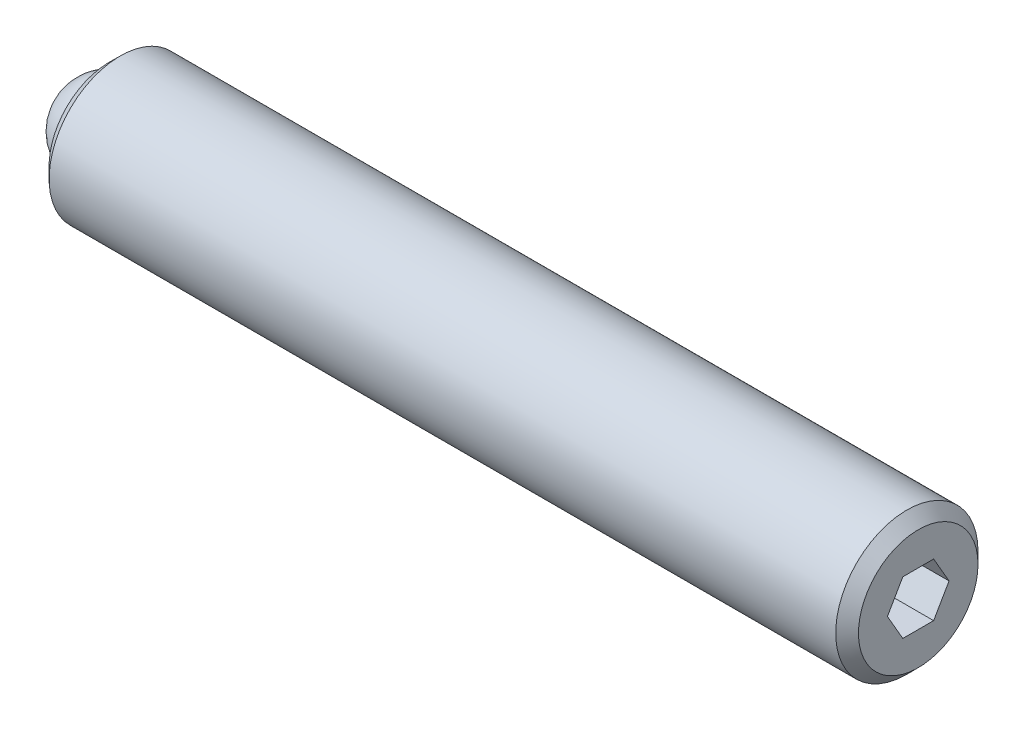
ISO-10303-21;
HEADER;
FILE_DESCRIPTION(('STEP AP214'),'2;1');
FILE_NAME('part.step','',(''),(''),'','','');
FILE_SCHEMA(('AUTOMOTIVE_DESIGN { 1 0 10303 214 1 1 1 1 }'));
ENDSEC;
DATA;
#1=APPLICATION_CONTEXT('core data for automotive mechanical design processes');
#2=APPLICATION_PROTOCOL_DEFINITION('international standard','automotive_design',2000,#1);
#3=PRODUCT_CONTEXT('',#1,'mechanical');
#4=PRODUCT('Part','Part','',(#3));
#5=PRODUCT_RELATED_PRODUCT_CATEGORY('part','',(#4));
#6=PRODUCT_DEFINITION_FORMATION('','',#4);
#7=PRODUCT_DEFINITION_CONTEXT('part definition',#1,'design');
#8=PRODUCT_DEFINITION('design','',#6,#7);
#9=PRODUCT_DEFINITION_SHAPE('','',#8);
#10=(LENGTH_UNIT() NAMED_UNIT(*) SI_UNIT(.MILLI.,.METRE.));
#11=(NAMED_UNIT(*) PLANE_ANGLE_UNIT() SI_UNIT($,.RADIAN.));
#12=(NAMED_UNIT(*) SI_UNIT($,.STERADIAN.) SOLID_ANGLE_UNIT());
#13=UNCERTAINTY_MEASURE_WITH_UNIT(LENGTH_MEASURE(1.E-05),#10,'distance_accuracy_value','');
#14=(GEOMETRIC_REPRESENTATION_CONTEXT(3) GLOBAL_UNCERTAINTY_ASSIGNED_CONTEXT((#13)) GLOBAL_UNIT_ASSIGNED_CONTEXT((#10,
#11,#12)) REPRESENTATION_CONTEXT('',''));
#15=CARTESIAN_POINT('',(0.,0.,0.));
#16=DIRECTION('',(0.,0.,1.));
#17=DIRECTION('',(1.,0.,0.));
#18=AXIS2_PLACEMENT_3D('',#15,#16,#17);
#19=CARTESIAN_POINT('',(0.,0.,0.));
#20=DIRECTION('',(0.,-1.,0.));
#21=DIRECTION('',(0.,0.,1.));
#22=AXIS2_PLACEMENT_3D('',#19,#20,#21);
#23=SPHERICAL_SURFACE('',#22,1.984375);
#24=CARTESIAN_POINT('',(0.,-1.984375,0.));
#25=VERTEX_POINT('',#24);
#26=VERTEX_LOOP('',#25);
#27=FACE_BOUND('',#26,.T.);
#28=ADVANCED_FACE('F43',(#27),#23,.T.);
#29=CLOSED_SHELL('',(#28));
#30=MANIFOLD_SOLID_BREP('B2',#29);
#31=CARTESIAN_POINT('',(36.115625,0.,0.));
#32=DIRECTION('',(-1.,0.,0.));
#33=DIRECTION('',(0.,0.,1.));
#34=AXIS2_PLACEMENT_3D('',#31,#32,#33);
#35=CYLINDRICAL_SURFACE('',#34,3.175);
#36=CARTESIAN_POINT('',(35.607625,0.,0.));
#37=DIRECTION('',(1.,0.,0.));
#38=DIRECTION('',(0.,0.,-1.));
#39=AXIS2_PLACEMENT_3D('',#36,#37,#38);
#40=CIRCLE('',#39,3.175);
#41=CARTESIAN_POINT('',(35.607625,0.,-3.175));
#42=VERTEX_POINT('',#41);
#43=EDGE_CURVE('E41',#42,#42,#40,.F.);
#44=ORIENTED_EDGE('',*,*,#43,.T.);
#45=EDGE_LOOP('',(#44));
#46=FACE_BOUND('',#45,.T.);
#47=CARTESIAN_POINT('',(0.508000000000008,0.,0.));
#48=DIRECTION('',(1.,0.,0.));
#49=DIRECTION('',(0.,0.,-1.));
#50=AXIS2_PLACEMENT_3D('',#47,#48,#49);
#51=CIRCLE('',#50,3.175);
#52=CARTESIAN_POINT('',(0.508000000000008,0.,-3.175));
#53=VERTEX_POINT('',#52);
#54=EDGE_CURVE('E159',#53,#53,#51,.T.);
#55=ORIENTED_EDGE('',*,*,#54,.T.);
#56=EDGE_LOOP('',(#55));
#57=FACE_BOUND('',#56,.T.);
#58=ADVANCED_FACE('F56',(#46,#57),#35,.T.);
#59=CARTESIAN_POINT('',(36.115625,0.,0.));
#60=DIRECTION('',(1.,0.,0.));
#61=DIRECTION('',(0.,0.,-1.));
#62=AXIS2_PLACEMENT_3D('',#59,#60,#61);
#63=PLANE('',#62);
#64=DIRECTION('',(0.,0.866025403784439,-0.5));
#65=VECTOR('',#64,1.);
#66=CARTESIAN_POINT('',(36.115625,-1.190625,-0.687407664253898));
#67=LINE('',#66,#65);
#68=CARTESIAN_POINT('',(36.115625,-1.190625,-0.687407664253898));
#69=VERTEX_POINT('',#68);
#70=CARTESIAN_POINT('',(36.115625,0.,-1.3748153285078));
#71=VERTEX_POINT('',#70);
#72=EDGE_CURVE('E71',#69,#71,#67,.T.);
#73=ORIENTED_EDGE('',*,*,#72,.F.);
#74=DIRECTION('',(0.,0.,-1.));
#75=VECTOR('',#74,1.);
#76=CARTESIAN_POINT('',(36.115625,-1.190625,0.687407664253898));
#77=LINE('',#76,#75);
#78=CARTESIAN_POINT('',(36.115625,-1.190625,0.687407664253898));
#79=VERTEX_POINT('',#78);
#80=EDGE_CURVE('E155',#79,#69,#77,.T.);
#81=ORIENTED_EDGE('',*,*,#80,.F.);
#82=DIRECTION('',(0.,-0.866025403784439,-0.5));
#83=VECTOR('',#82,1.);
#84=CARTESIAN_POINT('',(36.115625,0.,1.3748153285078));
#85=LINE('',#84,#83);
#86=CARTESIAN_POINT('',(36.115625,0.,1.3748153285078));
#87=VERTEX_POINT('',#86);
#88=EDGE_CURVE('E153',#87,#79,#85,.T.);
#89=ORIENTED_EDGE('',*,*,#88,.F.);
#90=DIRECTION('',(0.,-0.866025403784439,0.5));
#91=VECTOR('',#90,1.);
#92=CARTESIAN_POINT('',(36.115625,1.190625,0.687407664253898));
#93=LINE('',#92,#91);
#94=CARTESIAN_POINT('',(36.115625,1.190625,0.687407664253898));
#95=VERTEX_POINT('',#94);
#96=EDGE_CURVE('E119',#95,#87,#93,.T.);
#97=ORIENTED_EDGE('',*,*,#96,.F.);
#98=DIRECTION('',(0.,0.,1.));
#99=VECTOR('',#98,1.);
#100=CARTESIAN_POINT('',(36.115625,1.190625,-0.687407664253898));
#101=LINE('',#100,#99);
#102=CARTESIAN_POINT('',(36.115625,1.190625,-0.687407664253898));
#103=VERTEX_POINT('',#102);
#104=EDGE_CURVE('E149',#103,#95,#101,.T.);
#105=ORIENTED_EDGE('',*,*,#104,.F.);
#106=DIRECTION('',(0.,0.866025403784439,0.5));
#107=VECTOR('',#106,1.);
#108=CARTESIAN_POINT('',(36.115625,0.,-1.3748153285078));
#109=LINE('',#108,#107);
#110=EDGE_CURVE('E145',#71,#103,#109,.T.);
#111=ORIENTED_EDGE('',*,*,#110,.F.);
#112=EDGE_LOOP('',(#73,#81,#89,#97,#105,#111));
#113=FACE_BOUND('',#112,.T.);
#114=CARTESIAN_POINT('',(36.115625,0.,0.));
#115=DIRECTION('',(1.,0.,0.));
#116=DIRECTION('',(0.,0.,-1.));
#117=AXIS2_PLACEMENT_3D('',#114,#115,#116);
#118=CIRCLE('',#117,2.667);
#119=CARTESIAN_POINT('',(36.115625,0.,-2.667));
#120=VERTEX_POINT('',#119);
#121=EDGE_CURVE('E64',#120,#120,#118,.T.);
#122=ORIENTED_EDGE('',*,*,#121,.T.);
#123=EDGE_LOOP('',(#122));
#124=FACE_BOUND('',#123,.T.);
#125=ADVANCED_FACE('F172',(#113,#124),#63,.T.);
#126=CARTESIAN_POINT('',(0.,0.,0.));
#127=DIRECTION('',(1.,0.,0.));
#128=DIRECTION('',(0.,0.,-1.));
#129=AXIS2_PLACEMENT_3D('',#126,#127,#128);
#130=PLANE('',#129);
#131=CARTESIAN_POINT('',(0.,0.,0.));
#132=DIRECTION('',(-1.,0.,0.));
#133=DIRECTION('',(0.,0.,1.));
#134=AXIS2_PLACEMENT_3D('',#131,#132,#133);
#135=CIRCLE('',#134,1.9812);
#136=CARTESIAN_POINT('',(0.,0.,1.9812));
#137=VERTEX_POINT('',#136);
#138=EDGE_CURVE('E227',#137,#137,#135,.T.);
#139=ORIENTED_EDGE('',*,*,#138,.F.);
#140=EDGE_LOOP('',(#139));
#141=FACE_BOUND('',#140,.T.);
#142=CARTESIAN_POINT('',(0.,0.,0.));
#143=DIRECTION('',(1.,0.,0.));
#144=DIRECTION('',(0.,0.,-1.));
#145=AXIS2_PLACEMENT_3D('',#142,#143,#144);
#146=CIRCLE('',#145,2.66699999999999);
#147=CARTESIAN_POINT('',(0.,0.,-2.66699999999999));
#148=VERTEX_POINT('',#147);
#149=EDGE_CURVE('E167',#148,#148,#146,.F.);
#150=ORIENTED_EDGE('',*,*,#149,.T.);
#151=EDGE_LOOP('',(#150));
#152=FACE_BOUND('',#151,.T.);
#153=ADVANCED_FACE('F184',(#141,#152),#130,.F.);
#154=CARTESIAN_POINT('',(0.508000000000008,0.,0.));
#155=DIRECTION('',(1.,0.,0.));
#156=DIRECTION('',(0.,0.,-1.));
#157=AXIS2_PLACEMENT_3D('',#154,#155,#156);
#158=CONICAL_SURFACE('',#157,3.175,0.785398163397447);
#159=ORIENTED_EDGE('',*,*,#149,.F.);
#160=EDGE_LOOP('',(#159));
#161=FACE_BOUND('',#160,.T.);
#162=ORIENTED_EDGE('',*,*,#54,.F.);
#163=EDGE_LOOP('',(#162));
#164=FACE_BOUND('',#163,.T.);
#165=ADVANCED_FACE('F176',(#161,#164),#158,.T.);
#166=CARTESIAN_POINT('',(36.115625,0.,0.));
#167=DIRECTION('',(-1.,0.,0.));
#168=DIRECTION('',(0.,0.,1.));
#169=AXIS2_PLACEMENT_3D('',#166,#167,#168);
#170=CONICAL_SURFACE('',#169,2.667,0.785398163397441);
#171=ORIENTED_EDGE('',*,*,#43,.F.);
#172=EDGE_LOOP('',(#171));
#173=FACE_BOUND('',#172,.T.);
#174=ORIENTED_EDGE('',*,*,#121,.F.);
#175=EDGE_LOOP('',(#174));
#176=FACE_BOUND('',#175,.T.);
#177=ADVANCED_FACE('F58',(#173,#176),#170,.T.);
#178=CARTESIAN_POINT('',(33.829625,-1.190625,-0.687407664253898));
#179=DIRECTION('',(0.,-0.5,-0.866025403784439));
#180=DIRECTION('',(0.,0.866025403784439,-0.5));
#181=AXIS2_PLACEMENT_3D('',#178,#179,#180);
#182=PLANE('',#181);
#183=ORIENTED_EDGE('',*,*,#72,.T.);
#184=DIRECTION('',(1.,0.,0.));
#185=VECTOR('',#184,1.);
#186=CARTESIAN_POINT('',(33.829625,0.,-1.3748153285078));
#187=LINE('',#186,#185);
#188=CARTESIAN_POINT('',(33.829625,0.,-1.3748153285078));
#189=VERTEX_POINT('',#188);
#190=EDGE_CURVE('E101',#189,#71,#187,.T.);
#191=ORIENTED_EDGE('',*,*,#190,.F.);
#192=DIRECTION('',(0.,0.866025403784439,-0.5));
#193=VECTOR('',#192,1.);
#194=CARTESIAN_POINT('',(33.829625,-1.190625,-0.687407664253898));
#195=LINE('',#194,#193);
#196=CARTESIAN_POINT('',(33.829625,-1.190625,-0.687407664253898));
#197=VERTEX_POINT('',#196);
#198=EDGE_CURVE('E157',#197,#189,#195,.T.);
#199=ORIENTED_EDGE('',*,*,#198,.F.);
#200=DIRECTION('',(1.,0.,0.));
#201=VECTOR('',#200,1.);
#202=CARTESIAN_POINT('',(33.829625,-1.190625,-0.687407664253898));
#203=LINE('',#202,#201);
#204=EDGE_CURVE('E79',#197,#69,#203,.T.);
#205=ORIENTED_EDGE('',*,*,#204,.T.);
#206=EDGE_LOOP('',(#183,#191,#199,#205));
#207=FACE_BOUND('',#206,.T.);
#208=ADVANCED_FACE('F175',(#207),#182,.F.);
#209=CARTESIAN_POINT('',(33.829625,-1.190625,0.687407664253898));
#210=DIRECTION('',(0.,-1.,0.));
#211=DIRECTION('',(0.,0.,-1.));
#212=AXIS2_PLACEMENT_3D('',#209,#210,#211);
#213=PLANE('',#212);
#214=ORIENTED_EDGE('',*,*,#80,.T.);
#215=ORIENTED_EDGE('',*,*,#204,.F.);
#216=DIRECTION('',(0.,0.,-1.));
#217=VECTOR('',#216,1.);
#218=CARTESIAN_POINT('',(33.829625,-1.190625,0.687407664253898));
#219=LINE('',#218,#217);
#220=CARTESIAN_POINT('',(33.829625,-1.190625,0.687407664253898));
#221=VERTEX_POINT('',#220);
#222=EDGE_CURVE('E131',#221,#197,#219,.T.);
#223=ORIENTED_EDGE('',*,*,#222,.F.);
#224=DIRECTION('',(1.,0.,0.));
#225=VECTOR('',#224,1.);
#226=CARTESIAN_POINT('',(33.829625,-1.190625,0.687407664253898));
#227=LINE('',#226,#225);
#228=EDGE_CURVE('E123',#221,#79,#227,.T.);
#229=ORIENTED_EDGE('',*,*,#228,.T.);
#230=EDGE_LOOP('',(#214,#215,#223,#229));
#231=FACE_BOUND('',#230,.T.);
#232=ADVANCED_FACE('F182',(#231),#213,.F.);
#233=CARTESIAN_POINT('',(33.829625,0.,1.3748153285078));
#234=DIRECTION('',(0.,-0.5,0.866025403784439));
#235=DIRECTION('',(0.,-0.866025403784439,-0.5));
#236=AXIS2_PLACEMENT_3D('',#233,#234,#235);
#237=PLANE('',#236);
#238=ORIENTED_EDGE('',*,*,#88,.T.);
#239=ORIENTED_EDGE('',*,*,#228,.F.);
#240=DIRECTION('',(0.,-0.866025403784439,-0.5));
#241=VECTOR('',#240,1.);
#242=CARTESIAN_POINT('',(33.829625,0.,1.3748153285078));
#243=LINE('',#242,#241);
#244=CARTESIAN_POINT('',(33.829625,0.,1.3748153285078));
#245=VERTEX_POINT('',#244);
#246=EDGE_CURVE('E127',#245,#221,#243,.T.);
#247=ORIENTED_EDGE('',*,*,#246,.F.);
#248=DIRECTION('',(1.,0.,0.));
#249=VECTOR('',#248,1.);
#250=CARTESIAN_POINT('',(33.829625,0.,1.3748153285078));
#251=LINE('',#250,#249);
#252=EDGE_CURVE('E112',#245,#87,#251,.T.);
#253=ORIENTED_EDGE('',*,*,#252,.T.);
#254=EDGE_LOOP('',(#238,#239,#247,#253));
#255=FACE_BOUND('',#254,.T.);
#256=ADVANCED_FACE('F128',(#255),#237,.F.);
#257=CARTESIAN_POINT('',(33.829625,1.190625,0.687407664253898));
#258=DIRECTION('',(0.,0.5,0.866025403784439));
#259=DIRECTION('',(0.,-0.866025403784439,0.5));
#260=AXIS2_PLACEMENT_3D('',#257,#258,#259);
#261=PLANE('',#260);
#262=ORIENTED_EDGE('',*,*,#96,.T.);
#263=ORIENTED_EDGE('',*,*,#252,.F.);
#264=DIRECTION('',(0.,-0.866025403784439,0.5));
#265=VECTOR('',#264,1.);
#266=CARTESIAN_POINT('',(33.829625,1.190625,0.687407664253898));
#267=LINE('',#266,#265);
#268=CARTESIAN_POINT('',(33.829625,1.190625,0.687407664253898));
#269=VERTEX_POINT('',#268);
#270=EDGE_CURVE('E116',#269,#245,#267,.T.);
#271=ORIENTED_EDGE('',*,*,#270,.F.);
#272=DIRECTION('',(1.,0.,0.));
#273=VECTOR('',#272,1.);
#274=CARTESIAN_POINT('',(33.829625,1.190625,0.687407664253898));
#275=LINE('',#274,#273);
#276=EDGE_CURVE('E124',#269,#95,#275,.T.);
#277=ORIENTED_EDGE('',*,*,#276,.T.);
#278=EDGE_LOOP('',(#262,#263,#271,#277));
#279=FACE_BOUND('',#278,.T.);
#280=ADVANCED_FACE('F114',(#279),#261,.F.);
#281=CARTESIAN_POINT('',(33.829625,1.190625,-0.687407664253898));
#282=DIRECTION('',(0.,1.,0.));
#283=DIRECTION('',(0.,0.,1.));
#284=AXIS2_PLACEMENT_3D('',#281,#282,#283);
#285=PLANE('',#284);
#286=ORIENTED_EDGE('',*,*,#104,.T.);
#287=ORIENTED_EDGE('',*,*,#276,.F.);
#288=DIRECTION('',(0.,0.,1.));
#289=VECTOR('',#288,1.);
#290=CARTESIAN_POINT('',(33.829625,1.190625,-0.687407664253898));
#291=LINE('',#290,#289);
#292=CARTESIAN_POINT('',(33.829625,1.190625,-0.687407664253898));
#293=VERTEX_POINT('',#292);
#294=EDGE_CURVE('E137',#293,#269,#291,.T.);
#295=ORIENTED_EDGE('',*,*,#294,.F.);
#296=DIRECTION('',(1.,0.,0.));
#297=VECTOR('',#296,1.);
#298=CARTESIAN_POINT('',(33.829625,1.190625,-0.687407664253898));
#299=LINE('',#298,#297);
#300=EDGE_CURVE('E162',#293,#103,#299,.T.);
#301=ORIENTED_EDGE('',*,*,#300,.T.);
#302=EDGE_LOOP('',(#286,#287,#295,#301));
#303=FACE_BOUND('',#302,.T.);
#304=ADVANCED_FACE('F203',(#303),#285,.F.);
#305=CARTESIAN_POINT('',(33.829625,0.,-1.3748153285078));
#306=DIRECTION('',(0.,0.5,-0.866025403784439));
#307=DIRECTION('',(0.,0.866025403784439,0.5));
#308=AXIS2_PLACEMENT_3D('',#305,#306,#307);
#309=PLANE('',#308);
#310=ORIENTED_EDGE('',*,*,#110,.T.);
#311=ORIENTED_EDGE('',*,*,#300,.F.);
#312=DIRECTION('',(0.,0.866025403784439,0.5));
#313=VECTOR('',#312,1.);
#314=CARTESIAN_POINT('',(33.829625,0.,-1.3748153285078));
#315=LINE('',#314,#313);
#316=EDGE_CURVE('E139',#189,#293,#315,.T.);
#317=ORIENTED_EDGE('',*,*,#316,.F.);
#318=ORIENTED_EDGE('',*,*,#190,.T.);
#319=EDGE_LOOP('',(#310,#311,#317,#318));
#320=FACE_BOUND('',#319,.T.);
#321=ADVANCED_FACE('F200',(#320),#309,.F.);
#322=CARTESIAN_POINT('',(33.829625,0.,0.));
#323=DIRECTION('',(1.,0.,0.));
#324=DIRECTION('',(0.,0.,-1.));
#325=AXIS2_PLACEMENT_3D('',#322,#323,#324);
#326=PLANE('',#325);
#327=ORIENTED_EDGE('',*,*,#198,.T.);
#328=ORIENTED_EDGE('',*,*,#316,.T.);
#329=ORIENTED_EDGE('',*,*,#294,.T.);
#330=ORIENTED_EDGE('',*,*,#270,.T.);
#331=ORIENTED_EDGE('',*,*,#246,.T.);
#332=ORIENTED_EDGE('',*,*,#222,.T.);
#333=EDGE_LOOP('',(#327,#328,#329,#330,#331,#332));
#334=FACE_BOUND('',#333,.T.);
#335=ADVANCED_FACE('F134',(#334),#326,.T.);
#336=CARTESIAN_POINT('',(1.984375,0.,0.));
#337=DIRECTION('',(-1.,0.,0.));
#338=DIRECTION('',(0.,0.,1.));
#339=AXIS2_PLACEMENT_3D('',#336,#337,#338);
#340=CYLINDRICAL_SURFACE('',#339,1.9812);
#341=CARTESIAN_POINT('',(1.984375,0.,0.));
#342=DIRECTION('',(-1.,0.,0.));
#343=DIRECTION('',(0.,0.,1.));
#344=AXIS2_PLACEMENT_3D('',#341,#342,#343);
#345=CIRCLE('',#344,1.9812);
#346=CARTESIAN_POINT('',(1.984375,0.,1.9812));
#347=VERTEX_POINT('',#346);
#348=EDGE_CURVE('E146',#347,#347,#345,.T.);
#349=ORIENTED_EDGE('',*,*,#348,.F.);
#350=EDGE_LOOP('',(#349));
#351=FACE_BOUND('',#350,.T.);
#352=ORIENTED_EDGE('',*,*,#138,.T.);
#353=EDGE_LOOP('',(#352));
#354=FACE_BOUND('',#353,.T.);
#355=ADVANCED_FACE('F216',(#351,#354),#340,.F.);
#356=CARTESIAN_POINT('',(1.984375,0.,0.));
#357=DIRECTION('',(-1.,0.,0.));
#358=DIRECTION('',(0.,0.,1.));
#359=AXIS2_PLACEMENT_3D('',#356,#357,#358);
#360=PLANE('',#359);
#361=ORIENTED_EDGE('',*,*,#348,.T.);
#362=EDGE_LOOP('',(#361));
#363=FACE_BOUND('',#362,.T.);
#364=ADVANCED_FACE('F219',(#363),#360,.T.);
#365=CLOSED_SHELL('',(#58,#125,#153,#165,#177,#208,#232,#256,#280,#304,#321,#335,#355,#364));
#366=MANIFOLD_SOLID_BREP('B6',#365);
#367=ADVANCED_BREP_SHAPE_REPRESENTATION('',(#18,#30,#366),#14);
#368=SHAPE_DEFINITION_REPRESENTATION(#9,#367);
ENDSEC;
END-ISO-10303-21;
